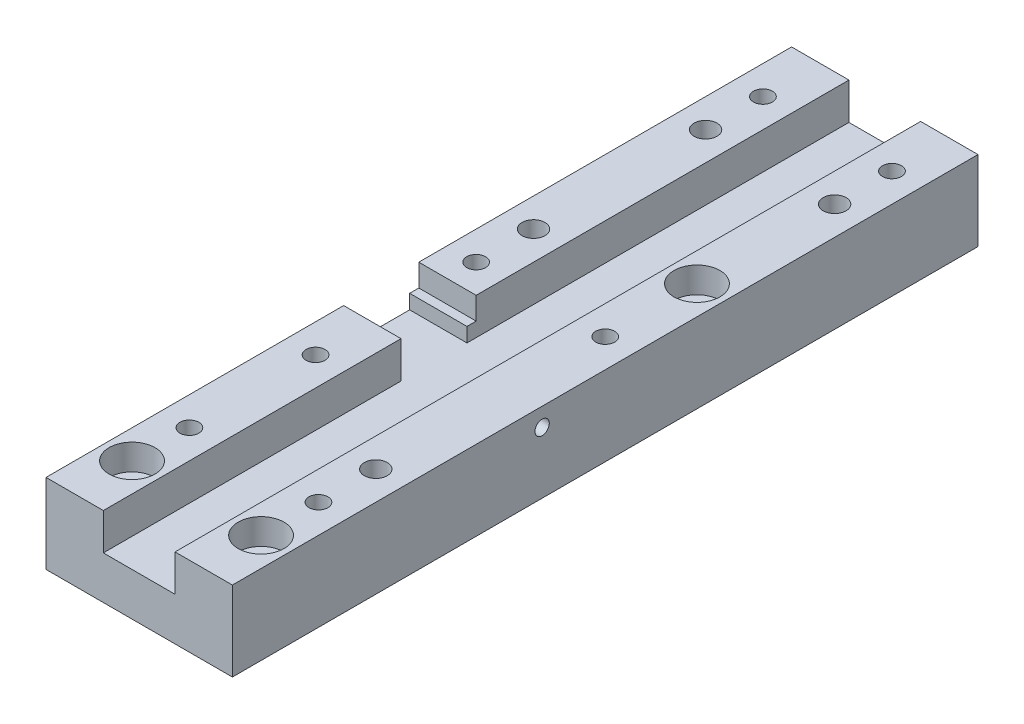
ISO-10303-21;
HEADER;
FILE_DESCRIPTION(('STEP AP214'),'2;1');
FILE_NAME('part.step','',(''),(''),'','','');
FILE_SCHEMA(('AUTOMOTIVE_DESIGN { 1 0 10303 214 1 1 1 1 }'));
ENDSEC;
DATA;
#1=APPLICATION_CONTEXT('core data for automotive mechanical design processes');
#2=APPLICATION_PROTOCOL_DEFINITION('international standard','automotive_design',2000,#1);
#3=PRODUCT_CONTEXT('',#1,'mechanical');
#4=PRODUCT('Part','Part','',(#3));
#5=PRODUCT_RELATED_PRODUCT_CATEGORY('part','',(#4));
#6=PRODUCT_DEFINITION_FORMATION('','',#4);
#7=PRODUCT_DEFINITION_CONTEXT('part definition',#1,'design');
#8=PRODUCT_DEFINITION('design','',#6,#7);
#9=PRODUCT_DEFINITION_SHAPE('','',#8);
#10=(LENGTH_UNIT() NAMED_UNIT(*) SI_UNIT(.MILLI.,.METRE.));
#11=(NAMED_UNIT(*) PLANE_ANGLE_UNIT() SI_UNIT($,.RADIAN.));
#12=(NAMED_UNIT(*) SI_UNIT($,.STERADIAN.) SOLID_ANGLE_UNIT());
#13=UNCERTAINTY_MEASURE_WITH_UNIT(LENGTH_MEASURE(1.E-05),#10,'distance_accuracy_value','');
#14=(GEOMETRIC_REPRESENTATION_CONTEXT(3) GLOBAL_UNCERTAINTY_ASSIGNED_CONTEXT((#13)) GLOBAL_UNIT_ASSIGNED_CONTEXT((#10,
#11,#12)) REPRESENTATION_CONTEXT('',''));
#15=CARTESIAN_POINT('',(0.,0.,0.));
#16=DIRECTION('',(0.,0.,1.));
#17=DIRECTION('',(1.,0.,0.));
#18=AXIS2_PLACEMENT_3D('',#15,#16,#17);
#19=CARTESIAN_POINT('',(0.,-7.73975065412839,66.6000000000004));
#20=DIRECTION('',(0.,0.,-1.));
#21=DIRECTION('',(-1.,0.,0.));
#22=AXIS2_PLACEMENT_3D('',#19,#20,#21);
#23=PLANE('',#22);
#24=DIRECTION('',(1.,0.,0.));
#25=VECTOR('',#24,1.);
#26=CARTESIAN_POINT('',(0.,9.99999999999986,66.6000000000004));
#27=LINE('',#26,#25);
#28=CARTESIAN_POINT('',(0.,9.99999999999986,66.6000000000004));
#29=VERTEX_POINT('',#28);
#30=CARTESIAN_POINT('',(10.,9.99999999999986,66.6000000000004));
#31=VERTEX_POINT('',#30);
#32=EDGE_CURVE('E347',#29,#31,#27,.T.);
#33=ORIENTED_EDGE('',*,*,#32,.F.);
#34=DIRECTION('',(0.,1.,0.));
#35=VECTOR('',#34,1.);
#36=CARTESIAN_POINT('',(0.,-7.73975065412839,66.6000000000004));
#37=LINE('',#36,#35);
#38=CARTESIAN_POINT('',(0.,7.49999999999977,66.6000000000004));
#39=VERTEX_POINT('',#38);
#40=EDGE_CURVE('E364',#39,#29,#37,.T.);
#41=ORIENTED_EDGE('',*,*,#40,.F.);
#42=DIRECTION('',(-1.,0.,0.));
#43=VECTOR('',#42,1.);
#44=CARTESIAN_POINT('',(0.,7.49999999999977,66.6000000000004));
#45=LINE('',#44,#43);
#46=CARTESIAN_POINT('',(10.,7.49999999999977,66.6000000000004));
#47=VERTEX_POINT('',#46);
#48=EDGE_CURVE('E332',#47,#39,#45,.T.);
#49=ORIENTED_EDGE('',*,*,#48,.F.);
#50=DIRECTION('',(0.,1.,0.));
#51=VECTOR('',#50,1.);
#52=CARTESIAN_POINT('',(10.,-7.73975065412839,66.6000000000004));
#53=LINE('',#52,#51);
#54=EDGE_CURVE('E358',#47,#31,#53,.T.);
#55=ORIENTED_EDGE('',*,*,#54,.T.);
#56=EDGE_LOOP('',(#33,#41,#49,#55));
#57=FACE_BOUND('',#56,.T.);
#58=ADVANCED_FACE('F32',(#57),#23,.F.);
#59=CARTESIAN_POINT('',(10.0000000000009,7.49999999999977,130.));
#60=DIRECTION('',(-1.,-1.42030484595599E-13,0.));
#61=DIRECTION('',(1.42030484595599E-13,-1.,0.));
#62=AXIS2_PLACEMENT_3D('',#59,#60,#61);
#63=PLANE('',#62);
#64=DIRECTION('',(0.,0.,-1.));
#65=VECTOR('',#64,1.);
#66=CARTESIAN_POINT('',(10.0000000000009,7.49999999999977,130.));
#67=LINE('',#66,#65);
#68=CARTESIAN_POINT('',(10.0000000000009,7.49999999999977,130.));
#69=VERTEX_POINT('',#68);
#70=CARTESIAN_POINT('',(10.,7.49999999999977,78.1000000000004));
#71=VERTEX_POINT('',#70);
#72=EDGE_CURVE('E11',#69,#71,#67,.T.);
#73=ORIENTED_EDGE('',*,*,#72,.T.);
#74=DIRECTION('',(0.,1.,0.));
#75=VECTOR('',#74,1.);
#76=CARTESIAN_POINT('',(10.,-7.73975065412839,78.1000000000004));
#77=LINE('',#76,#75);
#78=CARTESIAN_POINT('',(10.,13.8999999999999,78.1000000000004));
#79=VERTEX_POINT('',#78);
#80=EDGE_CURVE('E307',#71,#79,#77,.T.);
#81=ORIENTED_EDGE('',*,*,#80,.T.);
#82=DIRECTION('',(0.,0.,-1.));
#83=VECTOR('',#82,1.);
#84=CARTESIAN_POINT('',(10.,13.8999999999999,130.));
#85=LINE('',#84,#83);
#86=CARTESIAN_POINT('',(10.,13.8999999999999,130.));
#87=VERTEX_POINT('',#86);
#88=EDGE_CURVE('E173',#87,#79,#85,.T.);
#89=ORIENTED_EDGE('',*,*,#88,.F.);
#90=DIRECTION('',(-1.42030484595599E-13,1.,0.));
#91=VECTOR('',#90,1.);
#92=CARTESIAN_POINT('',(10.0000000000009,7.49999999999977,130.));
#93=LINE('',#92,#91);
#94=EDGE_CURVE('E99',#69,#87,#93,.T.);
#95=ORIENTED_EDGE('',*,*,#94,.F.);
#96=EDGE_LOOP('',(#73,#81,#89,#95));
#97=FACE_BOUND('',#96,.T.);
#98=ADVANCED_FACE('F304',(#97),#63,.F.);
#99=CARTESIAN_POINT('',(0.,13.8999999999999,130.));
#100=DIRECTION('',(0.,-1.,0.));
#101=DIRECTION('',(0.,0.,-1.));
#102=AXIS2_PLACEMENT_3D('',#99,#100,#101);
#103=PLANE('',#102);
#104=CARTESIAN_POINT('',(5.,13.8999999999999,88.));
#105=DIRECTION('',(0.,1.,0.));
#106=DIRECTION('',(0.,0.,1.));
#107=AXIS2_PLACEMENT_3D('',#104,#105,#106);
#108=CIRCLE('',#107,1.65);
#109=CARTESIAN_POINT('',(5.,13.8999999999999,89.65));
#110=VERTEX_POINT('',#109);
#111=EDGE_CURVE('E191',#110,#110,#108,.T.);
#112=ORIENTED_EDGE('',*,*,#111,.F.);
#113=EDGE_LOOP('',(#112));
#114=FACE_BOUND('',#113,.T.);
#115=CARTESIAN_POINT('',(5.,13.8999999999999,110.));
#116=DIRECTION('',(0.,1.,0.));
#117=DIRECTION('',(0.,0.,1.));
#118=AXIS2_PLACEMENT_3D('',#115,#116,#117);
#119=CIRCLE('',#118,1.65);
#120=CARTESIAN_POINT('',(5.,13.8999999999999,111.65));
#121=VERTEX_POINT('',#120);
#122=EDGE_CURVE('E195',#121,#121,#119,.T.);
#123=ORIENTED_EDGE('',*,*,#122,.F.);
#124=EDGE_LOOP('',(#123));
#125=FACE_BOUND('',#124,.T.);
#126=CARTESIAN_POINT('',(5.,13.8999999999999,120.));
#127=DIRECTION('',(0.,1.,0.));
#128=DIRECTION('',(0.,0.,1.));
#129=AXIS2_PLACEMENT_3D('',#126,#127,#128);
#130=CIRCLE('',#129,4.);
#131=CARTESIAN_POINT('',(5.,13.8999999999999,124.));
#132=VERTEX_POINT('',#131);
#133=EDGE_CURVE('E228',#132,#132,#130,.T.);
#134=ORIENTED_EDGE('',*,*,#133,.F.);
#135=EDGE_LOOP('',(#134));
#136=FACE_BOUND('',#135,.T.);
#137=ORIENTED_EDGE('',*,*,#88,.T.);
#138=DIRECTION('',(1.,0.,0.));
#139=VECTOR('',#138,1.);
#140=CARTESIAN_POINT('',(0.,13.8999999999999,78.1000000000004));
#141=LINE('',#140,#139);
#142=CARTESIAN_POINT('',(0.,13.8999999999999,78.1000000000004));
#143=VERTEX_POINT('',#142);
#144=EDGE_CURVE('E312',#143,#79,#141,.T.);
#145=ORIENTED_EDGE('',*,*,#144,.F.);
#146=DIRECTION('',(0.,0.,-1.));
#147=VECTOR('',#146,1.);
#148=CARTESIAN_POINT('',(0.,13.8999999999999,130.));
#149=LINE('',#148,#147);
#150=CARTESIAN_POINT('',(0.,13.8999999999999,130.));
#151=VERTEX_POINT('',#150);
#152=EDGE_CURVE('E169',#151,#143,#149,.T.);
#153=ORIENTED_EDGE('',*,*,#152,.F.);
#154=DIRECTION('',(-1.,0.,0.));
#155=VECTOR('',#154,1.);
#156=CARTESIAN_POINT('',(0.,13.8999999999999,130.));
#157=LINE('',#156,#155);
#158=EDGE_CURVE('E282',#87,#151,#157,.T.);
#159=ORIENTED_EDGE('',*,*,#158,.F.);
#160=EDGE_LOOP('',(#137,#145,#153,#159));
#161=FACE_BOUND('',#160,.T.);
#162=ADVANCED_FACE('F310',(#114,#125,#136,#161),#103,.F.);
#163=CARTESIAN_POINT('',(5.,-6.10000000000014,120.));
#164=DIRECTION('',(0.,1.,0.));
#165=DIRECTION('',(0.,0.,1.));
#166=AXIS2_PLACEMENT_3D('',#163,#164,#165);
#167=CYLINDRICAL_SURFACE('',#166,2.25);
#168=CARTESIAN_POINT('',(5.,-1.13624387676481E-13,120.));
#169=DIRECTION('',(0.,1.,0.));
#170=DIRECTION('',(0.,0.,1.));
#171=AXIS2_PLACEMENT_3D('',#168,#169,#170);
#172=CIRCLE('',#171,2.25);
#173=CARTESIAN_POINT('',(5.,-1.13624387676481E-13,122.25));
#174=VERTEX_POINT('',#173);
#175=EDGE_CURVE('E205',#174,#174,#172,.T.);
#176=ORIENTED_EDGE('',*,*,#175,.F.);
#177=EDGE_LOOP('',(#176));
#178=FACE_BOUND('',#177,.T.);
#179=CARTESIAN_POINT('',(5.,9.39999999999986,120.));
#180=DIRECTION('',(0.,1.,0.));
#181=DIRECTION('',(0.,0.,1.));
#182=AXIS2_PLACEMENT_3D('',#179,#180,#181);
#183=CIRCLE('',#182,2.25);
#184=CARTESIAN_POINT('',(5.,9.39999999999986,122.25));
#185=VERTEX_POINT('',#184);
#186=EDGE_CURVE('E36',#185,#185,#183,.F.);
#187=ORIENTED_EDGE('',*,*,#186,.F.);
#188=EDGE_LOOP('',(#187));
#189=FACE_BOUND('',#188,.T.);
#190=ADVANCED_FACE('F382',(#178,#189),#167,.F.);
#191=CARTESIAN_POINT('',(27.5,-6.10000000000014,120.));
#192=DIRECTION('',(0.,1.,0.));
#193=DIRECTION('',(0.,0.,1.));
#194=AXIS2_PLACEMENT_3D('',#191,#192,#193);
#195=CYLINDRICAL_SURFACE('',#194,2.25);
#196=CARTESIAN_POINT('',(27.5,-1.13624387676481E-13,120.));
#197=DIRECTION('',(0.,1.,0.));
#198=DIRECTION('',(0.,0.,1.));
#199=AXIS2_PLACEMENT_3D('',#196,#197,#198);
#200=CIRCLE('',#199,2.25);
#201=CARTESIAN_POINT('',(27.5,-1.13624387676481E-13,122.25));
#202=VERTEX_POINT('',#201);
#203=EDGE_CURVE('E208',#202,#202,#200,.T.);
#204=ORIENTED_EDGE('',*,*,#203,.F.);
#205=EDGE_LOOP('',(#204));
#206=FACE_BOUND('',#205,.T.);
#207=CARTESIAN_POINT('',(27.5,9.39999999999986,120.));
#208=DIRECTION('',(0.,1.,0.));
#209=DIRECTION('',(0.,0.,1.));
#210=AXIS2_PLACEMENT_3D('',#207,#208,#209);
#211=CIRCLE('',#210,2.25);
#212=CARTESIAN_POINT('',(27.5,9.39999999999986,122.25));
#213=VERTEX_POINT('',#212);
#214=EDGE_CURVE('E212',#213,#213,#211,.F.);
#215=ORIENTED_EDGE('',*,*,#214,.F.);
#216=EDGE_LOOP('',(#215));
#217=FACE_BOUND('',#216,.T.);
#218=ADVANCED_FACE('F390',(#206,#217),#195,.F.);
#219=CARTESIAN_POINT('',(27.5,-6.10000000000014,44.));
#220=DIRECTION('',(0.,1.,0.));
#221=DIRECTION('',(0.,0.,1.));
#222=AXIS2_PLACEMENT_3D('',#219,#220,#221);
#223=CYLINDRICAL_SURFACE('',#222,2.25);
#224=CARTESIAN_POINT('',(27.5,-1.13624387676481E-13,44.));
#225=DIRECTION('',(0.,1.,0.));
#226=DIRECTION('',(0.,0.,1.));
#227=AXIS2_PLACEMENT_3D('',#224,#225,#226);
#228=CIRCLE('',#227,2.25);
#229=CARTESIAN_POINT('',(27.5,-1.13624387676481E-13,46.25));
#230=VERTEX_POINT('',#229);
#231=EDGE_CURVE('E235',#230,#230,#228,.T.);
#232=ORIENTED_EDGE('',*,*,#231,.F.);
#233=EDGE_LOOP('',(#232));
#234=FACE_BOUND('',#233,.T.);
#235=CARTESIAN_POINT('',(27.5,9.39999999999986,44.));
#236=DIRECTION('',(0.,1.,0.));
#237=DIRECTION('',(0.,0.,1.));
#238=AXIS2_PLACEMENT_3D('',#235,#236,#237);
#239=CIRCLE('',#238,2.25);
#240=CARTESIAN_POINT('',(27.5,9.39999999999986,46.25));
#241=VERTEX_POINT('',#240);
#242=EDGE_CURVE('E209',#241,#241,#239,.F.);
#243=ORIENTED_EDGE('',*,*,#242,.F.);
#244=EDGE_LOOP('',(#243));
#245=FACE_BOUND('',#244,.T.);
#246=ADVANCED_FACE('F433',(#234,#245),#223,.F.);
#247=CARTESIAN_POINT('',(10.0000000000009,7.49999999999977,130.));
#248=DIRECTION('',(0.,-1.,0.));
#249=DIRECTION('',(0.,0.,-1.));
#250=AXIS2_PLACEMENT_3D('',#247,#248,#249);
#251=PLANE('',#250);
#252=DIRECTION('',(-1.,0.,0.));
#253=VECTOR('',#252,1.);
#254=CARTESIAN_POINT('',(10.0000000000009,7.49999999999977,0.));
#255=LINE('',#254,#253);
#256=CARTESIAN_POINT('',(22.5,7.49999999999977,0.));
#257=VERTEX_POINT('',#256);
#258=CARTESIAN_POINT('',(10.0000000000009,7.49999999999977,0.));
#259=VERTEX_POINT('',#258);
#260=EDGE_CURVE('E143',#257,#259,#255,.T.);
#261=ORIENTED_EDGE('',*,*,#260,.T.);
#262=EDGE_CURVE('E41',#47,#259,#67,.T.);
#263=ORIENTED_EDGE('',*,*,#262,.F.);
#264=ORIENTED_EDGE('',*,*,#48,.T.);
#265=DIRECTION('',(0.,0.,1.));
#266=VECTOR('',#265,1.);
#267=CARTESIAN_POINT('',(0.,7.49999999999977,66.6000000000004));
#268=LINE('',#267,#266);
#269=CARTESIAN_POINT('',(0.,7.49999999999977,78.1000000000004));
#270=VERTEX_POINT('',#269);
#271=EDGE_CURVE('E370',#39,#270,#268,.T.);
#272=ORIENTED_EDGE('',*,*,#271,.T.);
#273=DIRECTION('',(1.,0.,0.));
#274=VECTOR('',#273,1.);
#275=CARTESIAN_POINT('',(0.,7.49999999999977,78.1000000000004));
#276=LINE('',#275,#274);
#277=EDGE_CURVE('E366',#270,#71,#276,.T.);
#278=ORIENTED_EDGE('',*,*,#277,.T.);
#279=ORIENTED_EDGE('',*,*,#72,.F.);
#280=DIRECTION('',(-1.,0.,0.));
#281=VECTOR('',#280,1.);
#282=CARTESIAN_POINT('',(10.0000000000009,7.49999999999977,130.));
#283=LINE('',#282,#281);
#284=CARTESIAN_POINT('',(22.5,7.49999999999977,130.));
#285=VERTEX_POINT('',#284);
#286=EDGE_CURVE('E161',#285,#69,#283,.T.);
#287=ORIENTED_EDGE('',*,*,#286,.F.);
#288=DIRECTION('',(0.,0.,-1.));
#289=VECTOR('',#288,1.);
#290=CARTESIAN_POINT('',(22.5,7.49999999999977,130.));
#291=LINE('',#290,#289);
#292=EDGE_CURVE('E139',#285,#257,#291,.T.);
#293=ORIENTED_EDGE('',*,*,#292,.T.);
#294=EDGE_LOOP('',(#261,#263,#264,#272,#278,#279,#287,#293));
#295=FACE_BOUND('',#294,.T.);
#296=ADVANCED_FACE('F34',(#295),#251,.F.);
#297=CARTESIAN_POINT('',(10.,13.8999999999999,65.));
#298=VERTEX_POINT('',#297);
#299=CARTESIAN_POINT('',(10.,13.8999999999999,0.));
#300=VERTEX_POINT('',#299);
#301=EDGE_CURVE('E172',#298,#300,#85,.T.);
#302=ORIENTED_EDGE('',*,*,#301,.F.);
#303=DIRECTION('',(0.,1.,0.));
#304=VECTOR('',#303,1.);
#305=CARTESIAN_POINT('',(10.,9.99999999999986,65.));
#306=LINE('',#305,#304);
#307=CARTESIAN_POINT('',(10.,9.99999999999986,65.));
#308=VERTEX_POINT('',#307);
#309=EDGE_CURVE('E360',#308,#298,#306,.T.);
#310=ORIENTED_EDGE('',*,*,#309,.F.);
#311=DIRECTION('',(0.,0.,-1.));
#312=VECTOR('',#311,1.);
#313=CARTESIAN_POINT('',(10.,9.99999999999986,65.));
#314=LINE('',#313,#312);
#315=EDGE_CURVE('E350',#31,#308,#314,.T.);
#316=ORIENTED_EDGE('',*,*,#315,.F.);
#317=ORIENTED_EDGE('',*,*,#54,.F.);
#318=ORIENTED_EDGE('',*,*,#262,.T.);
#319=DIRECTION('',(-1.42030484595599E-13,1.,0.));
#320=VECTOR('',#319,1.);
#321=CARTESIAN_POINT('',(10.0000000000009,7.49999999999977,0.));
#322=LINE('',#321,#320);
#323=EDGE_CURVE('E146',#259,#300,#322,.T.);
#324=ORIENTED_EDGE('',*,*,#323,.T.);
#325=EDGE_LOOP('',(#302,#310,#316,#317,#318,#324));
#326=FACE_BOUND('',#325,.T.);
#327=ADVANCED_FACE('F357',(#326),#63,.F.);
#328=CARTESIAN_POINT('',(5.,13.8999999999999,20.));
#329=DIRECTION('',(0.,1.,0.));
#330=DIRECTION('',(0.,0.,1.));
#331=AXIS2_PLACEMENT_3D('',#328,#329,#330);
#332=CIRCLE('',#331,2.00000000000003);
#333=CARTESIAN_POINT('',(5.,13.8999999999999,22.));
#334=VERTEX_POINT('',#333);
#335=EDGE_CURVE('E204',#334,#334,#332,.T.);
#336=ORIENTED_EDGE('',*,*,#335,.F.);
#337=EDGE_LOOP('',(#336));
#338=FACE_BOUND('',#337,.T.);
#339=CARTESIAN_POINT('',(5.,13.8999999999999,50.));
#340=DIRECTION('',(0.,1.,0.));
#341=DIRECTION('',(0.,0.,1.));
#342=AXIS2_PLACEMENT_3D('',#339,#340,#341);
#343=CIRCLE('',#342,2.00000000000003);
#344=CARTESIAN_POINT('',(5.,13.8999999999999,52.));
#345=VERTEX_POINT('',#344);
#346=EDGE_CURVE('E200',#345,#345,#343,.T.);
#347=ORIENTED_EDGE('',*,*,#346,.F.);
#348=EDGE_LOOP('',(#347));
#349=FACE_BOUND('',#348,.T.);
#350=CARTESIAN_POINT('',(5.,13.8999999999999,60.));
#351=DIRECTION('',(0.,1.,0.));
#352=DIRECTION('',(0.,0.,1.));
#353=AXIS2_PLACEMENT_3D('',#350,#351,#352);
#354=CIRCLE('',#353,1.65);
#355=CARTESIAN_POINT('',(5.,13.8999999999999,61.65));
#356=VERTEX_POINT('',#355);
#357=EDGE_CURVE('E187',#356,#356,#354,.T.);
#358=ORIENTED_EDGE('',*,*,#357,.F.);
#359=EDGE_LOOP('',(#358));
#360=FACE_BOUND('',#359,.T.);
#361=CARTESIAN_POINT('',(5.00000000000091,13.8999999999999,10.));
#362=DIRECTION('',(0.,1.,0.));
#363=DIRECTION('',(0.,0.,1.));
#364=AXIS2_PLACEMENT_3D('',#361,#362,#363);
#365=CIRCLE('',#364,1.65);
#366=CARTESIAN_POINT('',(5.00000000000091,13.8999999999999,11.65));
#367=VERTEX_POINT('',#366);
#368=EDGE_CURVE('E183',#367,#367,#365,.T.);
#369=ORIENTED_EDGE('',*,*,#368,.F.);
#370=EDGE_LOOP('',(#369));
#371=FACE_BOUND('',#370,.T.);
#372=CARTESIAN_POINT('',(0.,13.8999999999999,65.));
#373=VERTEX_POINT('',#372);
#374=CARTESIAN_POINT('',(0.,13.8999999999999,0.));
#375=VERTEX_POINT('',#374);
#376=EDGE_CURVE('E168',#373,#375,#149,.T.);
#377=ORIENTED_EDGE('',*,*,#376,.F.);
#378=DIRECTION('',(-1.,0.,0.));
#379=VECTOR('',#378,1.);
#380=CARTESIAN_POINT('',(0.,13.8999999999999,65.));
#381=LINE('',#380,#379);
#382=EDGE_CURVE('E728',#298,#373,#381,.T.);
#383=ORIENTED_EDGE('',*,*,#382,.F.);
#384=ORIENTED_EDGE('',*,*,#301,.T.);
#385=DIRECTION('',(-1.,0.,0.));
#386=VECTOR('',#385,1.);
#387=CARTESIAN_POINT('',(0.,13.8999999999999,0.));
#388=LINE('',#387,#386);
#389=EDGE_CURVE('E150',#300,#375,#388,.T.);
#390=ORIENTED_EDGE('',*,*,#389,.T.);
#391=EDGE_LOOP('',(#377,#383,#384,#390));
#392=FACE_BOUND('',#391,.T.);
#393=ADVANCED_FACE('F385',(#338,#349,#360,#371,#392),#103,.F.);
#394=CARTESIAN_POINT('',(0.,-1.13686837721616E-13,130.));
#395=DIRECTION('',(1.,0.,0.));
#396=DIRECTION('',(0.,0.,-1.));
#397=AXIS2_PLACEMENT_3D('',#394,#395,#396);
#398=PLANE('',#397);
#399=DIRECTION('',(0.,0.,1.));
#400=VECTOR('',#399,1.);
#401=CARTESIAN_POINT('',(0.,9.99999999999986,65.));
#402=LINE('',#401,#400);
#403=CARTESIAN_POINT('',(0.,9.99999999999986,65.));
#404=VERTEX_POINT('',#403);
#405=EDGE_CURVE('E49',#404,#29,#402,.T.);
#406=ORIENTED_EDGE('',*,*,#405,.F.);
#407=DIRECTION('',(0.,1.,0.));
#408=VECTOR('',#407,1.);
#409=CARTESIAN_POINT('',(0.,9.99999999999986,65.));
#410=LINE('',#409,#408);
#411=EDGE_CURVE('E730',#404,#373,#410,.T.);
#412=ORIENTED_EDGE('',*,*,#411,.T.);
#413=ORIENTED_EDGE('',*,*,#376,.T.);
#414=DIRECTION('',(0.,-1.,0.));
#415=VECTOR('',#414,1.);
#416=CARTESIAN_POINT('',(0.,-1.13686837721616E-13,0.));
#417=LINE('',#416,#415);
#418=CARTESIAN_POINT('',(0.,-1.13686837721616E-13,0.));
#419=VERTEX_POINT('',#418);
#420=EDGE_CURVE('E153',#375,#419,#417,.T.);
#421=ORIENTED_EDGE('',*,*,#420,.T.);
#422=DIRECTION('',(0.,0.,-1.));
#423=VECTOR('',#422,1.);
#424=CARTESIAN_POINT('',(0.,-1.13686837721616E-13,130.));
#425=LINE('',#424,#423);
#426=CARTESIAN_POINT('',(0.,-1.13686837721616E-13,130.));
#427=VERTEX_POINT('',#426);
#428=EDGE_CURVE('E165',#427,#419,#425,.T.);
#429=ORIENTED_EDGE('',*,*,#428,.F.);
#430=DIRECTION('',(0.,-1.,0.));
#431=VECTOR('',#430,1.);
#432=CARTESIAN_POINT('',(0.,-1.13686837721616E-13,130.));
#433=LINE('',#432,#431);
#434=EDGE_CURVE('E284',#151,#427,#433,.T.);
#435=ORIENTED_EDGE('',*,*,#434,.F.);
#436=ORIENTED_EDGE('',*,*,#152,.T.);
#437=DIRECTION('',(0.,1.,0.));
#438=VECTOR('',#437,1.);
#439=CARTESIAN_POINT('',(0.,-7.73975065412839,78.1000000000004));
#440=LINE('',#439,#438);
#441=EDGE_CURVE('E316',#270,#143,#440,.T.);
#442=ORIENTED_EDGE('',*,*,#441,.F.);
#443=ORIENTED_EDGE('',*,*,#271,.F.);
#444=ORIENTED_EDGE('',*,*,#40,.T.);
#445=EDGE_LOOP('',(#406,#412,#413,#421,#429,#435,#436,#442,#443,#444));
#446=FACE_BOUND('',#445,.T.);
#447=ADVANCED_FACE('F290',(#446),#398,.F.);
#448=CARTESIAN_POINT('',(0.,-1.13686837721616E-13,130.));
#449=DIRECTION('',(0.,1.,0.));
#450=DIRECTION('',(0.,0.,1.));
#451=AXIS2_PLACEMENT_3D('',#448,#449,#450);
#452=PLANE('',#451);
#453=ORIENTED_EDGE('',*,*,#175,.T.);
#454=EDGE_LOOP('',(#453));
#455=FACE_BOUND('',#454,.T.);
#456=ORIENTED_EDGE('',*,*,#203,.T.);
#457=EDGE_LOOP('',(#456));
#458=FACE_BOUND('',#457,.T.);
#459=ORIENTED_EDGE('',*,*,#231,.T.);
#460=EDGE_LOOP('',(#459));
#461=FACE_BOUND('',#460,.T.);
#462=CARTESIAN_POINT('',(5.,-1.13624387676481E-13,20.));
#463=DIRECTION('',(0.,1.,0.));
#464=DIRECTION('',(0.,0.,1.));
#465=AXIS2_PLACEMENT_3D('',#462,#463,#464);
#466=CIRCLE('',#465,2.00000000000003);
#467=CARTESIAN_POINT('',(5.,-1.13624387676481E-13,22.));
#468=VERTEX_POINT('',#467);
#469=EDGE_CURVE('E201',#468,#468,#466,.T.);
#470=ORIENTED_EDGE('',*,*,#469,.T.);
#471=EDGE_LOOP('',(#470));
#472=FACE_BOUND('',#471,.T.);
#473=CARTESIAN_POINT('',(5.,-1.13624387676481E-13,50.));
#474=DIRECTION('',(0.,1.,0.));
#475=DIRECTION('',(0.,0.,1.));
#476=AXIS2_PLACEMENT_3D('',#473,#474,#475);
#477=CIRCLE('',#476,2.00000000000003);
#478=CARTESIAN_POINT('',(5.,-1.13624387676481E-13,52.));
#479=VERTEX_POINT('',#478);
#480=EDGE_CURVE('E196',#479,#479,#477,.T.);
#481=ORIENTED_EDGE('',*,*,#480,.T.);
#482=EDGE_LOOP('',(#481));
#483=FACE_BOUND('',#482,.T.);
#484=CARTESIAN_POINT('',(27.5,-1.13624387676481E-13,100.));
#485=DIRECTION('',(0.,1.,0.));
#486=DIRECTION('',(0.,0.,1.));
#487=AXIS2_PLACEMENT_3D('',#484,#485,#486);
#488=CIRCLE('',#487,2.00000000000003);
#489=CARTESIAN_POINT('',(27.5,-1.13624387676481E-13,102.));
#490=VERTEX_POINT('',#489);
#491=EDGE_CURVE('E244',#490,#490,#488,.T.);
#492=ORIENTED_EDGE('',*,*,#491,.T.);
#493=EDGE_LOOP('',(#492));
#494=FACE_BOUND('',#493,.T.);
#495=CARTESIAN_POINT('',(27.5,-1.13624387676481E-13,20.));
#496=DIRECTION('',(0.,1.,0.));
#497=DIRECTION('',(0.,0.,1.));
#498=AXIS2_PLACEMENT_3D('',#495,#496,#497);
#499=CIRCLE('',#498,2.00000000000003);
#500=CARTESIAN_POINT('',(27.5,-1.13624387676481E-13,22.));
#501=VERTEX_POINT('',#500);
#502=EDGE_CURVE('E250',#501,#501,#499,.T.);
#503=ORIENTED_EDGE('',*,*,#502,.T.);
#504=EDGE_LOOP('',(#503));
#505=FACE_BOUND('',#504,.T.);
#506=CARTESIAN_POINT('',(5.,-1.13624387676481E-13,110.));
#507=DIRECTION('',(0.,1.,0.));
#508=DIRECTION('',(0.,0.,1.));
#509=AXIS2_PLACEMENT_3D('',#506,#507,#508);
#510=CIRCLE('',#509,1.65);
#511=CARTESIAN_POINT('',(5.,-1.13624387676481E-13,111.65));
#512=VERTEX_POINT('',#511);
#513=EDGE_CURVE('E192',#512,#512,#510,.T.);
#514=ORIENTED_EDGE('',*,*,#513,.T.);
#515=EDGE_LOOP('',(#514));
#516=FACE_BOUND('',#515,.T.);
#517=CARTESIAN_POINT('',(5.,-1.13624387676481E-13,88.));
#518=DIRECTION('',(0.,1.,0.));
#519=DIRECTION('',(0.,0.,1.));
#520=AXIS2_PLACEMENT_3D('',#517,#518,#519);
#521=CIRCLE('',#520,1.65);
#522=CARTESIAN_POINT('',(5.,-1.13624387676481E-13,89.65));
#523=VERTEX_POINT('',#522);
#524=EDGE_CURVE('E188',#523,#523,#521,.T.);
#525=ORIENTED_EDGE('',*,*,#524,.T.);
#526=EDGE_LOOP('',(#525));
#527=FACE_BOUND('',#526,.T.);
#528=CARTESIAN_POINT('',(5.,-1.13624387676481E-13,60.));
#529=DIRECTION('',(0.,1.,0.));
#530=DIRECTION('',(0.,0.,1.));
#531=AXIS2_PLACEMENT_3D('',#528,#529,#530);
#532=CIRCLE('',#531,1.65);
#533=CARTESIAN_POINT('',(5.,-1.13624387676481E-13,61.65));
#534=VERTEX_POINT('',#533);
#535=EDGE_CURVE('E184',#534,#534,#532,.T.);
#536=ORIENTED_EDGE('',*,*,#535,.T.);
#537=EDGE_LOOP('',(#536));
#538=FACE_BOUND('',#537,.T.);
#539=CARTESIAN_POINT('',(5.00000000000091,-1.13624387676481E-13,10.));
#540=DIRECTION('',(0.,1.,0.));
#541=DIRECTION('',(0.,0.,1.));
#542=AXIS2_PLACEMENT_3D('',#539,#540,#541);
#543=CIRCLE('',#542,1.65);
#544=CARTESIAN_POINT('',(5.00000000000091,-1.13624387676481E-13,11.65));
#545=VERTEX_POINT('',#544);
#546=EDGE_CURVE('E179',#545,#545,#543,.T.);
#547=ORIENTED_EDGE('',*,*,#546,.T.);
#548=EDGE_LOOP('',(#547));
#549=FACE_BOUND('',#548,.T.);
#550=CARTESIAN_POINT('',(27.5000000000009,-1.13624387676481E-13,10.));
#551=DIRECTION('',(0.,1.,0.));
#552=DIRECTION('',(0.,0.,1.));
#553=AXIS2_PLACEMENT_3D('',#550,#551,#552);
#554=CIRCLE('',#553,1.65);
#555=CARTESIAN_POINT('',(27.5000000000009,-1.13624387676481E-13,11.65));
#556=VERTEX_POINT('',#555);
#557=EDGE_CURVE('E263',#556,#556,#554,.T.);
#558=ORIENTED_EDGE('',*,*,#557,.T.);
#559=EDGE_LOOP('',(#558));
#560=FACE_BOUND('',#559,.T.);
#561=CARTESIAN_POINT('',(27.5,-1.13624387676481E-13,60.));
#562=DIRECTION('',(0.,1.,0.));
#563=DIRECTION('',(0.,0.,1.));
#564=AXIS2_PLACEMENT_3D('',#561,#562,#563);
#565=CIRCLE('',#564,1.65);
#566=CARTESIAN_POINT('',(27.5,-1.13624387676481E-13,61.65));
#567=VERTEX_POINT('',#566);
#568=EDGE_CURVE('E269',#567,#567,#565,.T.);
#569=ORIENTED_EDGE('',*,*,#568,.T.);
#570=EDGE_LOOP('',(#569));
#571=FACE_BOUND('',#570,.T.);
#572=CARTESIAN_POINT('',(27.5,-1.13624387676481E-13,110.));
#573=DIRECTION('',(0.,1.,0.));
#574=DIRECTION('',(0.,0.,1.));
#575=AXIS2_PLACEMENT_3D('',#572,#573,#574);
#576=CIRCLE('',#575,1.65);
#577=CARTESIAN_POINT('',(27.5,-1.13624387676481E-13,111.65));
#578=VERTEX_POINT('',#577);
#579=EDGE_CURVE('E275',#578,#578,#576,.T.);
#580=ORIENTED_EDGE('',*,*,#579,.T.);
#581=EDGE_LOOP('',(#580));
#582=FACE_BOUND('',#581,.T.);
#583=DIRECTION('',(1.,0.,0.));
#584=VECTOR('',#583,1.);
#585=CARTESIAN_POINT('',(0.,-1.13686837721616E-13,0.));
#586=LINE('',#585,#584);
#587=CARTESIAN_POINT('',(32.5,-1.13686837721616E-13,0.));
#588=VERTEX_POINT('',#587);
#589=EDGE_CURVE('E155',#419,#588,#586,.T.);
#590=ORIENTED_EDGE('',*,*,#589,.T.);
#591=DIRECTION('',(0.,0.,-1.));
#592=VECTOR('',#591,1.);
#593=CARTESIAN_POINT('',(32.5,-1.13686837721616E-13,130.));
#594=LINE('',#593,#592);
#595=CARTESIAN_POINT('',(32.5,-1.13686837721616E-13,130.));
#596=VERTEX_POINT('',#595);
#597=EDGE_CURVE('E134',#596,#588,#594,.T.);
#598=ORIENTED_EDGE('',*,*,#597,.F.);
#599=DIRECTION('',(1.,0.,0.));
#600=VECTOR('',#599,1.);
#601=CARTESIAN_POINT('',(0.,-1.13686837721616E-13,130.));
#602=LINE('',#601,#600);
#603=EDGE_CURVE('E122',#427,#596,#602,.T.);
#604=ORIENTED_EDGE('',*,*,#603,.F.);
#605=ORIENTED_EDGE('',*,*,#428,.T.);
#606=EDGE_LOOP('',(#590,#598,#604,#605));
#607=FACE_BOUND('',#606,.T.);
#608=ADVANCED_FACE('F294',(#455,#458,#461,#472,#483,#494,#505,#516,#527,#538,#549,#560,#571,
#582,#607),#452,.F.);
#609=CARTESIAN_POINT('',(32.5,-1.13686837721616E-13,130.));
#610=DIRECTION('',(-1.,0.,0.));
#611=DIRECTION('',(0.,0.,1.));
#612=AXIS2_PLACEMENT_3D('',#609,#610,#611);
#613=PLANE('',#612);
#614=CARTESIAN_POINT('',(32.5,10.6999999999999,76.));
#615=DIRECTION('',(1.,0.,0.));
#616=DIRECTION('',(0.,0.,-1.));
#617=AXIS2_PLACEMENT_3D('',#614,#615,#616);
#618=CIRCLE('',#617,1.25);
#619=CARTESIAN_POINT('',(32.5,10.6999999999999,74.75));
#620=VERTEX_POINT('',#619);
#621=EDGE_CURVE('E178',#620,#620,#618,.T.);
#622=ORIENTED_EDGE('',*,*,#621,.F.);
#623=EDGE_LOOP('',(#622));
#624=FACE_BOUND('',#623,.T.);
#625=DIRECTION('',(0.,1.,0.));
#626=VECTOR('',#625,1.);
#627=CARTESIAN_POINT('',(32.5,-1.13686837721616E-13,0.));
#628=LINE('',#627,#626);
#629=CARTESIAN_POINT('',(32.5,13.8999999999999,0.));
#630=VERTEX_POINT('',#629);
#631=EDGE_CURVE('E131',#588,#630,#628,.T.);
#632=ORIENTED_EDGE('',*,*,#631,.T.);
#633=DIRECTION('',(0.,0.,-1.));
#634=VECTOR('',#633,1.);
#635=CARTESIAN_POINT('',(32.5,13.8999999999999,130.));
#636=LINE('',#635,#634);
#637=CARTESIAN_POINT('',(32.5,13.8999999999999,130.));
#638=VERTEX_POINT('',#637);
#639=EDGE_CURVE('E128',#638,#630,#636,.T.);
#640=ORIENTED_EDGE('',*,*,#639,.F.);
#641=DIRECTION('',(0.,1.,0.));
#642=VECTOR('',#641,1.);
#643=CARTESIAN_POINT('',(32.5,-1.13686837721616E-13,130.));
#644=LINE('',#643,#642);
#645=EDGE_CURVE('E115',#596,#638,#644,.T.);
#646=ORIENTED_EDGE('',*,*,#645,.F.);
#647=ORIENTED_EDGE('',*,*,#597,.T.);
#648=EDGE_LOOP('',(#632,#640,#646,#647));
#649=FACE_BOUND('',#648,.T.);
#650=ADVANCED_FACE('F129',(#624,#649),#613,.F.);
#651=CARTESIAN_POINT('',(22.5,13.8999999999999,130.));
#652=DIRECTION('',(0.,-1.,0.));
#653=DIRECTION('',(0.,0.,-1.));
#654=AXIS2_PLACEMENT_3D('',#651,#652,#653);
#655=PLANE('',#654);
#656=CARTESIAN_POINT('',(27.5,13.8999999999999,120.));
#657=DIRECTION('',(0.,1.,0.));
#658=DIRECTION('',(0.,0.,1.));
#659=AXIS2_PLACEMENT_3D('',#656,#657,#658);
#660=CIRCLE('',#659,4.);
#661=CARTESIAN_POINT('',(27.5,13.8999999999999,124.));
#662=VERTEX_POINT('',#661);
#663=EDGE_CURVE('E221',#662,#662,#660,.T.);
#664=ORIENTED_EDGE('',*,*,#663,.F.);
#665=EDGE_LOOP('',(#664));
#666=FACE_BOUND('',#665,.T.);
#667=CARTESIAN_POINT('',(27.5,13.8999999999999,44.));
#668=DIRECTION('',(0.,1.,0.));
#669=DIRECTION('',(0.,0.,1.));
#670=AXIS2_PLACEMENT_3D('',#667,#668,#669);
#671=CIRCLE('',#670,4.);
#672=CARTESIAN_POINT('',(27.5,13.8999999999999,48.));
#673=VERTEX_POINT('',#672);
#674=EDGE_CURVE('E214',#673,#673,#671,.T.);
#675=ORIENTED_EDGE('',*,*,#674,.F.);
#676=EDGE_LOOP('',(#675));
#677=FACE_BOUND('',#676,.T.);
#678=CARTESIAN_POINT('',(27.5,13.8999999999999,100.));
#679=DIRECTION('',(0.,1.,0.));
#680=DIRECTION('',(0.,0.,1.));
#681=AXIS2_PLACEMENT_3D('',#678,#679,#680);
#682=CIRCLE('',#681,2.00000000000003);
#683=CARTESIAN_POINT('',(27.5,13.8999999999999,102.));
#684=VERTEX_POINT('',#683);
#685=EDGE_CURVE('E199',#684,#684,#682,.T.);
#686=ORIENTED_EDGE('',*,*,#685,.F.);
#687=EDGE_LOOP('',(#686));
#688=FACE_BOUND('',#687,.T.);
#689=CARTESIAN_POINT('',(27.5,13.8999999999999,20.));
#690=DIRECTION('',(0.,1.,0.));
#691=DIRECTION('',(0.,0.,1.));
#692=AXIS2_PLACEMENT_3D('',#689,#690,#691);
#693=CIRCLE('',#692,2.00000000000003);
#694=CARTESIAN_POINT('',(27.5,13.8999999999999,22.));
#695=VERTEX_POINT('',#694);
#696=EDGE_CURVE('E247',#695,#695,#693,.T.);
#697=ORIENTED_EDGE('',*,*,#696,.F.);
#698=EDGE_LOOP('',(#697));
#699=FACE_BOUND('',#698,.T.);
#700=CARTESIAN_POINT('',(27.5000000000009,13.8999999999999,10.));
#701=DIRECTION('',(0.,1.,0.));
#702=DIRECTION('',(0.,0.,1.));
#703=AXIS2_PLACEMENT_3D('',#700,#701,#702);
#704=CIRCLE('',#703,1.65);
#705=CARTESIAN_POINT('',(27.5000000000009,13.8999999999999,11.65));
#706=VERTEX_POINT('',#705);
#707=EDGE_CURVE('E182',#706,#706,#704,.T.);
#708=ORIENTED_EDGE('',*,*,#707,.F.);
#709=EDGE_LOOP('',(#708));
#710=FACE_BOUND('',#709,.T.);
#711=CARTESIAN_POINT('',(27.5,13.8999999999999,60.));
#712=DIRECTION('',(0.,1.,0.));
#713=DIRECTION('',(0.,0.,1.));
#714=AXIS2_PLACEMENT_3D('',#711,#712,#713);
#715=CIRCLE('',#714,1.65);
#716=CARTESIAN_POINT('',(27.5,13.8999999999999,61.65));
#717=VERTEX_POINT('',#716);
#718=EDGE_CURVE('E266',#717,#717,#715,.T.);
#719=ORIENTED_EDGE('',*,*,#718,.F.);
#720=EDGE_LOOP('',(#719));
#721=FACE_BOUND('',#720,.T.);
#722=CARTESIAN_POINT('',(27.5,13.8999999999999,110.));
#723=DIRECTION('',(0.,1.,0.));
#724=DIRECTION('',(0.,0.,1.));
#725=AXIS2_PLACEMENT_3D('',#722,#723,#724);
#726=CIRCLE('',#725,1.65);
#727=CARTESIAN_POINT('',(27.5,13.8999999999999,111.65));
#728=VERTEX_POINT('',#727);
#729=EDGE_CURVE('E272',#728,#728,#726,.T.);
#730=ORIENTED_EDGE('',*,*,#729,.F.);
#731=EDGE_LOOP('',(#730));
#732=FACE_BOUND('',#731,.T.);
#733=DIRECTION('',(-1.,0.,0.));
#734=VECTOR('',#733,1.);
#735=CARTESIAN_POINT('',(22.5,13.8999999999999,0.));
#736=LINE('',#735,#734);
#737=CARTESIAN_POINT('',(22.5,13.8999999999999,0.));
#738=VERTEX_POINT('',#737);
#739=EDGE_CURVE('E158',#630,#738,#736,.T.);
#740=ORIENTED_EDGE('',*,*,#739,.T.);
#741=DIRECTION('',(0.,0.,-1.));
#742=VECTOR('',#741,1.);
#743=CARTESIAN_POINT('',(22.5,13.8999999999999,130.));
#744=LINE('',#743,#742);
#745=CARTESIAN_POINT('',(22.5,13.8999999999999,130.));
#746=VERTEX_POINT('',#745);
#747=EDGE_CURVE('E135',#746,#738,#744,.T.);
#748=ORIENTED_EDGE('',*,*,#747,.F.);
#749=DIRECTION('',(-1.,0.,0.));
#750=VECTOR('',#749,1.);
#751=CARTESIAN_POINT('',(22.5,13.8999999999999,130.));
#752=LINE('',#751,#750);
#753=EDGE_CURVE('E119',#638,#746,#752,.T.);
#754=ORIENTED_EDGE('',*,*,#753,.F.);
#755=ORIENTED_EDGE('',*,*,#639,.T.);
#756=EDGE_LOOP('',(#740,#748,#754,#755));
#757=FACE_BOUND('',#756,.T.);
#758=ADVANCED_FACE('F137',(#666,#677,#688,#699,#710,#721,#732,#757),#655,.F.);
#759=CARTESIAN_POINT('',(22.5,7.49999999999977,130.));
#760=DIRECTION('',(1.,0.,0.));
#761=DIRECTION('',(0.,0.,-1.));
#762=AXIS2_PLACEMENT_3D('',#759,#760,#761);
#763=PLANE('',#762);
#764=CARTESIAN_POINT('',(22.5,10.6999999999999,76.));
#765=DIRECTION('',(1.,0.,0.));
#766=DIRECTION('',(0.,0.,-1.));
#767=AXIS2_PLACEMENT_3D('',#764,#765,#766);
#768=CIRCLE('',#767,1.25);
#769=CARTESIAN_POINT('',(22.5,10.6999999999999,74.75));
#770=VERTEX_POINT('',#769);
#771=EDGE_CURVE('E147',#770,#770,#768,.T.);
#772=ORIENTED_EDGE('',*,*,#771,.T.);
#773=EDGE_LOOP('',(#772));
#774=FACE_BOUND('',#773,.T.);
#775=DIRECTION('',(0.,-1.,0.));
#776=VECTOR('',#775,1.);
#777=CARTESIAN_POINT('',(22.5,7.49999999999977,0.));
#778=LINE('',#777,#776);
#779=EDGE_CURVE('E91',#738,#257,#778,.T.);
#780=ORIENTED_EDGE('',*,*,#779,.T.);
#781=ORIENTED_EDGE('',*,*,#292,.F.);
#782=DIRECTION('',(0.,-1.,0.));
#783=VECTOR('',#782,1.);
#784=CARTESIAN_POINT('',(22.5,7.49999999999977,130.));
#785=LINE('',#784,#783);
#786=EDGE_CURVE('E58',#746,#285,#785,.T.);
#787=ORIENTED_EDGE('',*,*,#786,.F.);
#788=ORIENTED_EDGE('',*,*,#747,.T.);
#789=EDGE_LOOP('',(#780,#781,#787,#788));
#790=FACE_BOUND('',#789,.T.);
#791=ADVANCED_FACE('F298',(#774,#790),#763,.F.);
#792=CARTESIAN_POINT('',(22.5,7.49999999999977,130.));
#793=DIRECTION('',(0.,0.,1.));
#794=DIRECTION('',(1.,0.,0.));
#795=AXIS2_PLACEMENT_3D('',#792,#793,#794);
#796=PLANE('',#795);
#797=ORIENTED_EDGE('',*,*,#286,.T.);
#798=ORIENTED_EDGE('',*,*,#94,.T.);
#799=ORIENTED_EDGE('',*,*,#158,.T.);
#800=ORIENTED_EDGE('',*,*,#434,.T.);
#801=ORIENTED_EDGE('',*,*,#603,.T.);
#802=ORIENTED_EDGE('',*,*,#645,.T.);
#803=ORIENTED_EDGE('',*,*,#753,.T.);
#804=ORIENTED_EDGE('',*,*,#786,.T.);
#805=EDGE_LOOP('',(#797,#798,#799,#800,#801,#802,#803,#804));
#806=FACE_BOUND('',#805,.T.);
#807=ADVANCED_FACE('F117',(#806),#796,.T.);
#808=CARTESIAN_POINT('',(22.5,7.49999999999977,0.));
#809=DIRECTION('',(0.,0.,1.));
#810=DIRECTION('',(1.,0.,0.));
#811=AXIS2_PLACEMENT_3D('',#808,#809,#810);
#812=PLANE('',#811);
#813=ORIENTED_EDGE('',*,*,#260,.F.);
#814=ORIENTED_EDGE('',*,*,#779,.F.);
#815=ORIENTED_EDGE('',*,*,#739,.F.);
#816=ORIENTED_EDGE('',*,*,#631,.F.);
#817=ORIENTED_EDGE('',*,*,#589,.F.);
#818=ORIENTED_EDGE('',*,*,#420,.F.);
#819=ORIENTED_EDGE('',*,*,#389,.F.);
#820=ORIENTED_EDGE('',*,*,#323,.F.);
#821=EDGE_LOOP('',(#813,#814,#815,#816,#817,#818,#819,#820));
#822=FACE_BOUND('',#821,.T.);
#823=ADVANCED_FACE('F297',(#822),#812,.F.);
#824=CARTESIAN_POINT('',(12.5,10.6999999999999,76.));
#825=DIRECTION('',(1.,0.,0.));
#826=DIRECTION('',(0.,0.,-1.));
#827=AXIS2_PLACEMENT_3D('',#824,#825,#826);
#828=CYLINDRICAL_SURFACE('',#827,1.25);
#829=ORIENTED_EDGE('',*,*,#621,.T.);
#830=EDGE_LOOP('',(#829));
#831=FACE_BOUND('',#830,.T.);
#832=ORIENTED_EDGE('',*,*,#771,.F.);
#833=EDGE_LOOP('',(#832));
#834=FACE_BOUND('',#833,.T.);
#835=ADVANCED_FACE('F480',(#831,#834),#828,.F.);
#836=CARTESIAN_POINT('',(27.5,-6.10000000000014,110.));
#837=DIRECTION('',(0.,1.,0.));
#838=DIRECTION('',(0.,0.,1.));
#839=AXIS2_PLACEMENT_3D('',#836,#837,#838);
#840=CYLINDRICAL_SURFACE('',#839,1.65);
#841=ORIENTED_EDGE('',*,*,#729,.T.);
#842=EDGE_LOOP('',(#841));
#843=FACE_BOUND('',#842,.T.);
#844=ORIENTED_EDGE('',*,*,#579,.F.);
#845=EDGE_LOOP('',(#844));
#846=FACE_BOUND('',#845,.T.);
#847=ADVANCED_FACE('F476',(#843,#846),#840,.F.);
#848=CARTESIAN_POINT('',(27.5,-6.10000000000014,60.));
#849=DIRECTION('',(0.,1.,0.));
#850=DIRECTION('',(0.,0.,1.));
#851=AXIS2_PLACEMENT_3D('',#848,#849,#850);
#852=CYLINDRICAL_SURFACE('',#851,1.65);
#853=ORIENTED_EDGE('',*,*,#718,.T.);
#854=EDGE_LOOP('',(#853));
#855=FACE_BOUND('',#854,.T.);
#856=ORIENTED_EDGE('',*,*,#568,.F.);
#857=EDGE_LOOP('',(#856));
#858=FACE_BOUND('',#857,.T.);
#859=ADVANCED_FACE('F472',(#855,#858),#852,.F.);
#860=CARTESIAN_POINT('',(27.5000000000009,-6.10000000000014,10.));
#861=DIRECTION('',(0.,1.,0.));
#862=DIRECTION('',(0.,0.,1.));
#863=AXIS2_PLACEMENT_3D('',#860,#861,#862);
#864=CYLINDRICAL_SURFACE('',#863,1.65);
#865=ORIENTED_EDGE('',*,*,#707,.T.);
#866=EDGE_LOOP('',(#865));
#867=FACE_BOUND('',#866,.T.);
#868=ORIENTED_EDGE('',*,*,#557,.F.);
#869=EDGE_LOOP('',(#868));
#870=FACE_BOUND('',#869,.T.);
#871=ADVANCED_FACE('F468',(#867,#870),#864,.F.);
#872=CARTESIAN_POINT('',(5.00000000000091,-6.10000000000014,10.));
#873=DIRECTION('',(0.,1.,0.));
#874=DIRECTION('',(0.,0.,1.));
#875=AXIS2_PLACEMENT_3D('',#872,#873,#874);
#876=CYLINDRICAL_SURFACE('',#875,1.65);
#877=ORIENTED_EDGE('',*,*,#368,.T.);
#878=EDGE_LOOP('',(#877));
#879=FACE_BOUND('',#878,.T.);
#880=ORIENTED_EDGE('',*,*,#546,.F.);
#881=EDGE_LOOP('',(#880));
#882=FACE_BOUND('',#881,.T.);
#883=ADVANCED_FACE('F464',(#879,#882),#876,.F.);
#884=CARTESIAN_POINT('',(5.,-6.10000000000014,60.));
#885=DIRECTION('',(0.,1.,0.));
#886=DIRECTION('',(0.,0.,1.));
#887=AXIS2_PLACEMENT_3D('',#884,#885,#886);
#888=CYLINDRICAL_SURFACE('',#887,1.65);
#889=ORIENTED_EDGE('',*,*,#357,.T.);
#890=EDGE_LOOP('',(#889));
#891=FACE_BOUND('',#890,.T.);
#892=ORIENTED_EDGE('',*,*,#535,.F.);
#893=EDGE_LOOP('',(#892));
#894=FACE_BOUND('',#893,.T.);
#895=ADVANCED_FACE('F460',(#891,#894),#888,.F.);
#896=CARTESIAN_POINT('',(5.,-6.10000000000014,88.));
#897=DIRECTION('',(0.,1.,0.));
#898=DIRECTION('',(0.,0.,1.));
#899=AXIS2_PLACEMENT_3D('',#896,#897,#898);
#900=CYLINDRICAL_SURFACE('',#899,1.65);
#901=ORIENTED_EDGE('',*,*,#111,.T.);
#902=EDGE_LOOP('',(#901));
#903=FACE_BOUND('',#902,.T.);
#904=ORIENTED_EDGE('',*,*,#524,.F.);
#905=EDGE_LOOP('',(#904));
#906=FACE_BOUND('',#905,.T.);
#907=ADVANCED_FACE('F456',(#903,#906),#900,.F.);
#908=CARTESIAN_POINT('',(5.,-6.10000000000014,110.));
#909=DIRECTION('',(0.,1.,0.));
#910=DIRECTION('',(0.,0.,1.));
#911=AXIS2_PLACEMENT_3D('',#908,#909,#910);
#912=CYLINDRICAL_SURFACE('',#911,1.65);
#913=ORIENTED_EDGE('',*,*,#122,.T.);
#914=EDGE_LOOP('',(#913));
#915=FACE_BOUND('',#914,.T.);
#916=ORIENTED_EDGE('',*,*,#513,.F.);
#917=EDGE_LOOP('',(#916));
#918=FACE_BOUND('',#917,.T.);
#919=ADVANCED_FACE('F452',(#915,#918),#912,.F.);
#920=CARTESIAN_POINT('',(27.5,-6.10000000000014,20.));
#921=DIRECTION('',(0.,1.,0.));
#922=DIRECTION('',(0.,0.,1.));
#923=AXIS2_PLACEMENT_3D('',#920,#921,#922);
#924=CYLINDRICAL_SURFACE('',#923,2.00000000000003);
#925=ORIENTED_EDGE('',*,*,#696,.T.);
#926=EDGE_LOOP('',(#925));
#927=FACE_BOUND('',#926,.T.);
#928=ORIENTED_EDGE('',*,*,#502,.F.);
#929=EDGE_LOOP('',(#928));
#930=FACE_BOUND('',#929,.T.);
#931=ADVANCED_FACE('F448',(#927,#930),#924,.F.);
#932=CARTESIAN_POINT('',(27.5,-6.10000000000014,100.));
#933=DIRECTION('',(0.,1.,0.));
#934=DIRECTION('',(0.,0.,1.));
#935=AXIS2_PLACEMENT_3D('',#932,#933,#934);
#936=CYLINDRICAL_SURFACE('',#935,2.00000000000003);
#937=ORIENTED_EDGE('',*,*,#685,.T.);
#938=EDGE_LOOP('',(#937));
#939=FACE_BOUND('',#938,.T.);
#940=ORIENTED_EDGE('',*,*,#491,.F.);
#941=EDGE_LOOP('',(#940));
#942=FACE_BOUND('',#941,.T.);
#943=ADVANCED_FACE('F444',(#939,#942),#936,.F.);
#944=CARTESIAN_POINT('',(5.,-6.10000000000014,50.));
#945=DIRECTION('',(0.,1.,0.));
#946=DIRECTION('',(0.,0.,1.));
#947=AXIS2_PLACEMENT_3D('',#944,#945,#946);
#948=CYLINDRICAL_SURFACE('',#947,2.00000000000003);
#949=ORIENTED_EDGE('',*,*,#346,.T.);
#950=EDGE_LOOP('',(#949));
#951=FACE_BOUND('',#950,.T.);
#952=ORIENTED_EDGE('',*,*,#480,.F.);
#953=EDGE_LOOP('',(#952));
#954=FACE_BOUND('',#953,.T.);
#955=ADVANCED_FACE('F440',(#951,#954),#948,.F.);
#956=CARTESIAN_POINT('',(5.,-6.10000000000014,20.));
#957=DIRECTION('',(0.,1.,0.));
#958=DIRECTION('',(0.,0.,1.));
#959=AXIS2_PLACEMENT_3D('',#956,#957,#958);
#960=CYLINDRICAL_SURFACE('',#959,2.00000000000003);
#961=ORIENTED_EDGE('',*,*,#335,.T.);
#962=EDGE_LOOP('',(#961));
#963=FACE_BOUND('',#962,.T.);
#964=ORIENTED_EDGE('',*,*,#469,.F.);
#965=EDGE_LOOP('',(#964));
#966=FACE_BOUND('',#965,.T.);
#967=ADVANCED_FACE('F426',(#963,#966),#960,.F.);
#968=CARTESIAN_POINT('',(27.5,9.39999999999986,44.));
#969=DIRECTION('',(0.,1.,0.));
#970=DIRECTION('',(0.,0.,1.));
#971=AXIS2_PLACEMENT_3D('',#968,#969,#970);
#972=PLANE('',#971);
#973=CARTESIAN_POINT('',(27.5,9.39999999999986,44.));
#974=DIRECTION('',(0.,1.,0.));
#975=DIRECTION('',(0.,0.,1.));
#976=AXIS2_PLACEMENT_3D('',#973,#974,#975);
#977=CIRCLE('',#976,4.);
#978=CARTESIAN_POINT('',(27.5,9.39999999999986,48.));
#979=VERTEX_POINT('',#978);
#980=EDGE_CURVE('E211',#979,#979,#977,.T.);
#981=ORIENTED_EDGE('',*,*,#980,.T.);
#982=EDGE_LOOP('',(#981));
#983=FACE_BOUND('',#982,.T.);
#984=ORIENTED_EDGE('',*,*,#242,.T.);
#985=EDGE_LOOP('',(#984));
#986=FACE_BOUND('',#985,.T.);
#987=ADVANCED_FACE('F423',(#983,#986),#972,.T.);
#988=CARTESIAN_POINT('',(27.5,9.39999999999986,44.));
#989=DIRECTION('',(0.,1.,0.));
#990=DIRECTION('',(0.,0.,1.));
#991=AXIS2_PLACEMENT_3D('',#988,#989,#990);
#992=CYLINDRICAL_SURFACE('',#991,4.);
#993=ORIENTED_EDGE('',*,*,#980,.F.);
#994=EDGE_LOOP('',(#993));
#995=FACE_BOUND('',#994,.T.);
#996=ORIENTED_EDGE('',*,*,#674,.T.);
#997=EDGE_LOOP('',(#996));
#998=FACE_BOUND('',#997,.T.);
#999=ADVANCED_FACE('F419',(#995,#998),#992,.F.);
#1000=CARTESIAN_POINT('',(27.5,9.39999999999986,120.));
#1001=DIRECTION('',(0.,1.,0.));
#1002=DIRECTION('',(0.,0.,1.));
#1003=AXIS2_PLACEMENT_3D('',#1000,#1001,#1002);
#1004=PLANE('',#1003);
#1005=CARTESIAN_POINT('',(27.5,9.39999999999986,120.));
#1006=DIRECTION('',(0.,1.,0.));
#1007=DIRECTION('',(0.,0.,1.));
#1008=AXIS2_PLACEMENT_3D('',#1005,#1006,#1007);
#1009=CIRCLE('',#1008,4.);
#1010=CARTESIAN_POINT('',(27.5,9.39999999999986,124.));
#1011=VERTEX_POINT('',#1010);
#1012=EDGE_CURVE('E215',#1011,#1011,#1009,.T.);
#1013=ORIENTED_EDGE('',*,*,#1012,.T.);
#1014=EDGE_LOOP('',(#1013));
#1015=FACE_BOUND('',#1014,.T.);
#1016=ORIENTED_EDGE('',*,*,#214,.T.);
#1017=EDGE_LOOP('',(#1016));
#1018=FACE_BOUND('',#1017,.T.);
#1019=ADVANCED_FACE('F416',(#1015,#1018),#1004,.T.);
#1020=CARTESIAN_POINT('',(27.5,9.39999999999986,120.));
#1021=DIRECTION('',(0.,1.,0.));
#1022=DIRECTION('',(0.,0.,1.));
#1023=AXIS2_PLACEMENT_3D('',#1020,#1021,#1022);
#1024=CYLINDRICAL_SURFACE('',#1023,4.);
#1025=ORIENTED_EDGE('',*,*,#1012,.F.);
#1026=EDGE_LOOP('',(#1025));
#1027=FACE_BOUND('',#1026,.T.);
#1028=ORIENTED_EDGE('',*,*,#663,.T.);
#1029=EDGE_LOOP('',(#1028));
#1030=FACE_BOUND('',#1029,.T.);
#1031=ADVANCED_FACE('F412',(#1027,#1030),#1024,.F.);
#1032=CARTESIAN_POINT('',(5.,9.39999999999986,120.));
#1033=DIRECTION('',(0.,1.,0.));
#1034=DIRECTION('',(0.,0.,1.));
#1035=AXIS2_PLACEMENT_3D('',#1032,#1033,#1034);
#1036=PLANE('',#1035);
#1037=CARTESIAN_POINT('',(5.,9.39999999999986,120.));
#1038=DIRECTION('',(0.,1.,0.));
#1039=DIRECTION('',(0.,0.,1.));
#1040=AXIS2_PLACEMENT_3D('',#1037,#1038,#1039);
#1041=CIRCLE('',#1040,4.);
#1042=CARTESIAN_POINT('',(5.,9.39999999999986,124.));
#1043=VERTEX_POINT('',#1042);
#1044=EDGE_CURVE('E371',#1043,#1043,#1041,.T.);
#1045=ORIENTED_EDGE('',*,*,#1044,.T.);
#1046=EDGE_LOOP('',(#1045));
#1047=FACE_BOUND('',#1046,.T.);
#1048=ORIENTED_EDGE('',*,*,#186,.T.);
#1049=EDGE_LOOP('',(#1048));
#1050=FACE_BOUND('',#1049,.T.);
#1051=ADVANCED_FACE('F409',(#1047,#1050),#1036,.T.);
#1052=CARTESIAN_POINT('',(5.,9.39999999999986,120.));
#1053=DIRECTION('',(0.,1.,0.));
#1054=DIRECTION('',(0.,0.,1.));
#1055=AXIS2_PLACEMENT_3D('',#1052,#1053,#1054);
#1056=CYLINDRICAL_SURFACE('',#1055,4.);
#1057=ORIENTED_EDGE('',*,*,#1044,.F.);
#1058=EDGE_LOOP('',(#1057));
#1059=FACE_BOUND('',#1058,.T.);
#1060=ORIENTED_EDGE('',*,*,#133,.T.);
#1061=EDGE_LOOP('',(#1060));
#1062=FACE_BOUND('',#1061,.T.);
#1063=ADVANCED_FACE('F379',(#1059,#1062),#1056,.F.);
#1064=CARTESIAN_POINT('',(0.,-7.73975065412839,78.1000000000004));
#1065=DIRECTION('',(0.,0.,1.));
#1066=DIRECTION('',(1.,0.,0.));
#1067=AXIS2_PLACEMENT_3D('',#1064,#1065,#1066);
#1068=PLANE('',#1067);
#1069=ORIENTED_EDGE('',*,*,#441,.T.);
#1070=ORIENTED_EDGE('',*,*,#144,.T.);
#1071=ORIENTED_EDGE('',*,*,#80,.F.);
#1072=ORIENTED_EDGE('',*,*,#277,.F.);
#1073=EDGE_LOOP('',(#1069,#1070,#1071,#1072));
#1074=FACE_BOUND('',#1073,.T.);
#1075=ADVANCED_FACE('F406',(#1074),#1068,.F.);
#1076=CARTESIAN_POINT('',(0.,9.99999999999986,65.));
#1077=DIRECTION('',(0.,0.,-1.));
#1078=DIRECTION('',(-1.,0.,0.));
#1079=AXIS2_PLACEMENT_3D('',#1076,#1077,#1078);
#1080=PLANE('',#1079);
#1081=ORIENTED_EDGE('',*,*,#382,.T.);
#1082=ORIENTED_EDGE('',*,*,#411,.F.);
#1083=DIRECTION('',(-1.,0.,0.));
#1084=VECTOR('',#1083,1.);
#1085=CARTESIAN_POINT('',(0.,9.99999999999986,65.));
#1086=LINE('',#1085,#1084);
#1087=EDGE_CURVE('E361',#308,#404,#1086,.T.);
#1088=ORIENTED_EDGE('',*,*,#1087,.F.);
#1089=ORIENTED_EDGE('',*,*,#309,.T.);
#1090=EDGE_LOOP('',(#1081,#1082,#1088,#1089));
#1091=FACE_BOUND('',#1090,.T.);
#1092=ADVANCED_FACE('F404',(#1091),#1080,.F.);
#1093=CARTESIAN_POINT('',(0.,9.99999999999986,66.6000000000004));
#1094=DIRECTION('',(0.,1.,0.));
#1095=DIRECTION('',(0.,0.,1.));
#1096=AXIS2_PLACEMENT_3D('',#1093,#1094,#1095);
#1097=PLANE('',#1096);
#1098=ORIENTED_EDGE('',*,*,#405,.T.);
#1099=ORIENTED_EDGE('',*,*,#32,.T.);
#1100=ORIENTED_EDGE('',*,*,#315,.T.);
#1101=ORIENTED_EDGE('',*,*,#1087,.T.);
#1102=EDGE_LOOP('',(#1098,#1099,#1100,#1101));
#1103=FACE_BOUND('',#1102,.T.);
#1104=ADVANCED_FACE('F349',(#1103),#1097,.T.);
#1105=CLOSED_SHELL('',(#58,#98,#162,#190,#218,#246,#296,#327,#393,#447,#608,#650,#758,#791,#807,
#823,#835,#847,#859,#871,#883,#895,#907,#919,#931,#943,#955,#967,#987,#999,#1019,#1031,#1051,
#1063,#1075,#1092,#1104));
#1106=MANIFOLD_SOLID_BREP('B2',#1105);
#1107=ADVANCED_BREP_SHAPE_REPRESENTATION('',(#18,#1106),#14);
#1108=SHAPE_DEFINITION_REPRESENTATION(#9,#1107);
ENDSEC;
END-ISO-10303-21;
